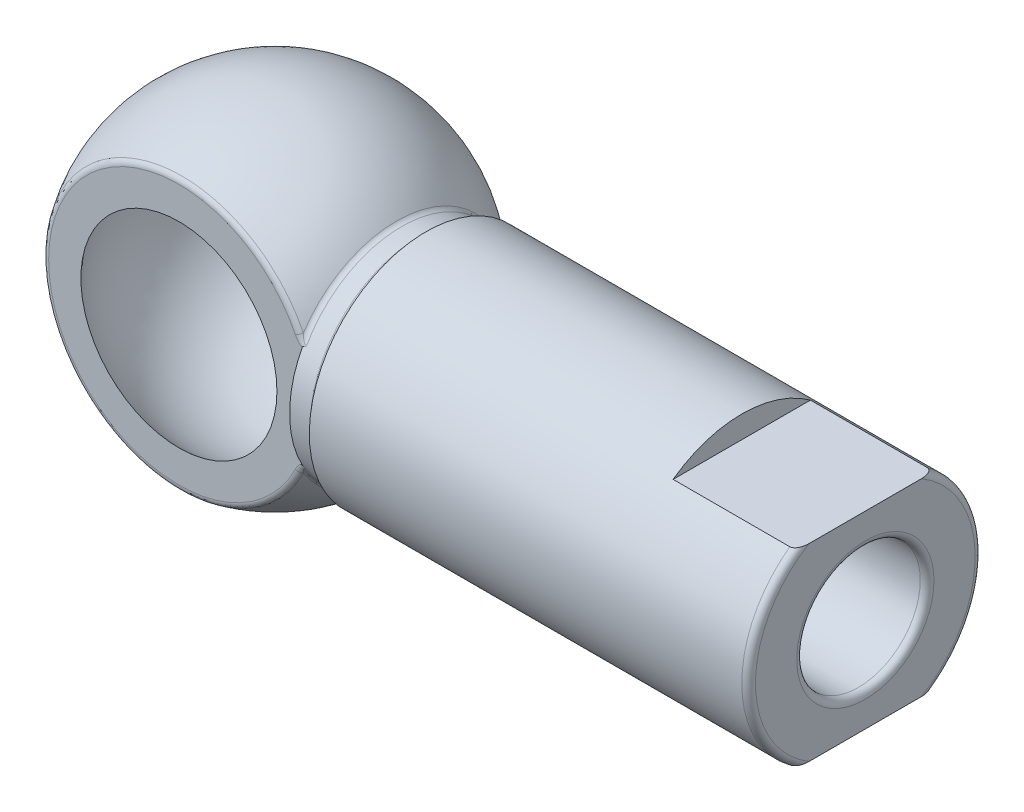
ISO-10303-21;
HEADER;
FILE_DESCRIPTION(('STEP AP214'),'2;1');
FILE_NAME('part.step','',(''),(''),'','','');
FILE_SCHEMA(('AUTOMOTIVE_DESIGN { 1 0 10303 214 1 1 1 1 }'));
ENDSEC;
DATA;
#1=APPLICATION_CONTEXT('core data for automotive mechanical design processes');
#2=APPLICATION_PROTOCOL_DEFINITION('international standard','automotive_design',2000,#1);
#3=PRODUCT_CONTEXT('',#1,'mechanical');
#4=PRODUCT('Part','Part','',(#3));
#5=PRODUCT_RELATED_PRODUCT_CATEGORY('part','',(#4));
#6=PRODUCT_DEFINITION_FORMATION('','',#4);
#7=PRODUCT_DEFINITION_CONTEXT('part definition',#1,'design');
#8=PRODUCT_DEFINITION('design','',#6,#7);
#9=PRODUCT_DEFINITION_SHAPE('','',#8);
#10=(LENGTH_UNIT() NAMED_UNIT(*) SI_UNIT(.MILLI.,.METRE.));
#11=(NAMED_UNIT(*) PLANE_ANGLE_UNIT() SI_UNIT($,.RADIAN.));
#12=(NAMED_UNIT(*) SI_UNIT($,.STERADIAN.) SOLID_ANGLE_UNIT());
#13=UNCERTAINTY_MEASURE_WITH_UNIT(LENGTH_MEASURE(1.E-05),#10,'distance_accuracy_value','');
#14=(GEOMETRIC_REPRESENTATION_CONTEXT(3) GLOBAL_UNCERTAINTY_ASSIGNED_CONTEXT((#13)) GLOBAL_UNIT_ASSIGNED_CONTEXT((#10,
#11,#12)) REPRESENTATION_CONTEXT('',''));
#15=CARTESIAN_POINT('',(0.,0.,0.));
#16=DIRECTION('',(0.,0.,1.));
#17=DIRECTION('',(1.,0.,0.));
#18=AXIS2_PLACEMENT_3D('',#15,#16,#17);
#19=CARTESIAN_POINT('',(0.,6.,3.5));
#20=DIRECTION('',(0.,0.,1.));
#21=DIRECTION('',(1.,0.,0.));
#22=AXIS2_PLACEMENT_3D('',#19,#20,#21);
#23=PLANE('',#22);
#24=CARTESIAN_POINT('',(0.,6.,3.5));
#25=DIRECTION('',(0.,0.,1.));
#26=DIRECTION('',(1.,0.,0.));
#27=AXIS2_PLACEMENT_3D('',#24,#25,#26);
#28=CIRCLE('',#27,3.57071421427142);
#29=CARTESIAN_POINT('',(3.57071421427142,6.,3.5));
#30=VERTEX_POINT('',#29);
#31=EDGE_CURVE('E158',#30,#30,#28,.F.);
#32=ORIENTED_EDGE('',*,*,#31,.T.);
#33=EDGE_LOOP('',(#32));
#34=FACE_BOUND('',#33,.T.);
#35=CARTESIAN_POINT('',(0.,6.,3.5));
#36=DIRECTION('',(0.,0.,1.));
#37=DIRECTION('',(1.,0.,0.));
#38=AXIS2_PLACEMENT_3D('',#35,#36,#37);
#39=CIRCLE('',#38,4.74341649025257);
#40=CARTESIAN_POINT('',(4.24255548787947,8.12149073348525,3.5));
#41=VERTEX_POINT('',#40);
#42=CARTESIAN_POINT('',(4.24255548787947,3.87850926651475,3.5));
#43=VERTEX_POINT('',#42);
#44=EDGE_CURVE('E173',#41,#43,#39,.T.);
#45=ORIENTED_EDGE('',*,*,#44,.T.);
#46=CARTESIAN_POINT('',(4.70713409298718,4.1739484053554,3.5));
#47=CARTESIAN_POINT('',(4.68135937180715,4.10917663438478,3.5));
#48=CARTESIAN_POINT('',(4.65930372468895,4.05375088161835,3.46392711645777));
#49=CARTESIAN_POINT('',(4.69370479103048,4.17933354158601,3.5));
#50=CARTESIAN_POINT('',(4.67163926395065,4.11453738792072,3.5));
#51=CARTESIAN_POINT('',(4.65258907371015,4.05876059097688,3.46522809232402));
#52=CARTESIAN_POINT('',(4.67982011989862,4.18366827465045,3.5));
#53=CARTESIAN_POINT('',(4.66151355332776,4.11886056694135,3.5));
#54=CARTESIAN_POINT('',(4.64564673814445,4.06279844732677,3.46627411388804));
#55=CARTESIAN_POINT('',(4.6515632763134,4.18997125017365,3.5));
#56=CARTESIAN_POINT('',(4.64086396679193,4.12514338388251,3.5));
#57=CARTESIAN_POINT('',(4.63151831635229,4.0686736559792,3.46779421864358));
#58=CARTESIAN_POINT('',(4.63719234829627,4.19194512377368,3.5));
#59=CARTESIAN_POINT('',(4.6303292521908,4.12711627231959,3.5));
#60=CARTESIAN_POINT('',(4.62433285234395,4.07051624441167,3.4682696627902));
#61=CARTESIAN_POINT('',(4.60825410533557,4.19329187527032,3.5));
#62=CARTESIAN_POINT('',(4.60911687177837,4.12846048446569,3.5));
#63=CARTESIAN_POINT('',(4.6098637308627,4.07177322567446,3.46859409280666));
#64=CARTESIAN_POINT('',(4.59368620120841,4.19265314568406,3.5));
#65=CARTESIAN_POINT('',(4.59842447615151,4.12782201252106,3.5));
#66=CARTESIAN_POINT('',(4.60257977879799,4.07117678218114,3.4684402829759));
#67=CARTESIAN_POINT('',(4.56491075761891,4.18884175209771,3.5));
#68=CARTESIAN_POINT('',(4.57735027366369,4.12401989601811,3.5));
#69=CARTESIAN_POINT('',(4.5881920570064,4.0676210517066,3.46752177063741));
#70=CARTESIAN_POINT('',(4.55070300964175,4.1856705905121,3.5));
#71=CARTESIAN_POINT('',(4.56695480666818,4.12085278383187,3.5));
#72=CARTESIAN_POINT('',(4.58108818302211,4.06466316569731,3.46675743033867));
#73=CARTESIAN_POINT('',(4.50314323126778,4.17095174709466,3.5));
#74=CARTESIAN_POINT('',(4.5322687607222,4.10615988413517,3.5));
#75=CARTESIAN_POINT('',(4.55730829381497,4.0509556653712,3.46320474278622));
#76=CARTESIAN_POINT('',(4.47148156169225,4.15391077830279,3.5));
#77=CARTESIAN_POINT('',(4.5094051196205,4.08910384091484,3.5));
#78=CARTESIAN_POINT('',(4.54147745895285,4.0351128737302,3.45908516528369));
#79=CARTESIAN_POINT('',(4.41992944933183,4.11688378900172,3.5));
#80=CARTESIAN_POINT('',(4.47298761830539,4.0524044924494,3.5));
#81=CARTESIAN_POINT('',(4.51570140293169,4.00093010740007,3.45008537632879));
#82=CARTESIAN_POINT('',(4.39895727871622,4.09822405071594,3.5));
#83=CARTESIAN_POINT('',(4.4584368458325,4.03389073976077,3.5));
#84=CARTESIAN_POINT('',(4.50521531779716,3.98377364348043,3.44553579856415));
#85=CARTESIAN_POINT('',(4.35992104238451,4.05801917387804,3.5));
#86=CARTESIAN_POINT('',(4.43194703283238,3.99421908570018,3.5));
#87=CARTESIAN_POINT('',(4.48569719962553,3.9470297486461,3.43569511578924));
#88=CARTESIAN_POINT('',(4.34186227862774,4.0364689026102,3.5));
#89=CARTESIAN_POINT('',(4.42001799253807,3.9729900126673,3.5));
#90=CARTESIAN_POINT('',(4.47666781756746,3.92743799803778,3.43040269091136));
#91=CARTESIAN_POINT('',(4.30924052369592,3.99275958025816,3.5));
#92=CARTESIAN_POINT('',(4.39913473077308,3.93018854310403,3.5));
#93=CARTESIAN_POINT('',(4.46035693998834,3.88795814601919,3.41963252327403));
#94=CARTESIAN_POINT('',(4.29453898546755,3.97070101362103,3.5));
#95=CARTESIAN_POINT('',(4.39005854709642,3.90864071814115,3.5));
#96=CARTESIAN_POINT('',(4.45300617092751,3.86814710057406,3.41418144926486));
#97=CARTESIAN_POINT('',(4.26711587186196,3.92541129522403,3.5));
#98=CARTESIAN_POINT('',(4.37380297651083,3.86464894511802,3.5));
#99=CARTESIAN_POINT('',(4.43929461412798,3.82773144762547,3.40296159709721));
#100=CARTESIAN_POINT('',(4.25439326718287,3.90218076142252,3.5));
#101=CARTESIAN_POINT('',(4.36664007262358,3.84216887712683,3.5));
#102=CARTESIAN_POINT('',(4.4329333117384,3.80712725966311,3.39719298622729));
#103=CARTESIAN_POINT('',(4.22727881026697,3.84796115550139,3.5));
#104=CARTESIAN_POINT('',(4.35221685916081,3.78991929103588,3.5));
#105=CARTESIAN_POINT('',(4.41937608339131,3.75935489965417,3.38370504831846));
#106=CARTESIAN_POINT('',(4.21347571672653,3.81667866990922,3.5));
#107=CARTESIAN_POINT('',(4.34561350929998,3.76001783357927,3.5));
#108=CARTESIAN_POINT('',(4.41247453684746,3.73201869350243,3.37590585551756));
#109=CARTESIAN_POINT('',(4.18854467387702,3.75303758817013,3.5));
#110=CARTESIAN_POINT('',(4.33516873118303,3.69979581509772,3.5));
#111=CARTESIAN_POINT('',(4.40000901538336,3.67689331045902,3.36002206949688));
#112=CARTESIAN_POINT('',(4.17741969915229,3.72067784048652,3.5));
#113=CARTESIAN_POINT('',(4.33138394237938,3.66942227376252,3.5));
#114=CARTESIAN_POINT('',(4.39444652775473,3.64910366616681,3.35193717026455));
#115=CARTESIAN_POINT('',(4.15776146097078,3.65526989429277,3.5));
#116=CARTESIAN_POINT('',(4.32654697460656,3.60878352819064,3.5));
#117=CARTESIAN_POINT('',(4.3846174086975,3.59343278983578,3.33559819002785));
#118=CARTESIAN_POINT('',(4.14922190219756,3.62222358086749,3.5));
#119=CARTESIAN_POINT('',(4.32555058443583,3.57847396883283,3.5));
#120=CARTESIAN_POINT('',(4.3803476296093,3.56555195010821,3.32734457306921));
#121=CARTESIAN_POINT('',(4.13470586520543,3.55564646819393,3.5));
#122=CARTESIAN_POINT('',(4.32629287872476,3.51834245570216,3.5));
#123=CARTESIAN_POINT('',(4.373089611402,3.50987869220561,3.31073883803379));
#124=CARTESIAN_POINT('',(4.12872392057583,3.52211686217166,3.5));
#125=CARTESIAN_POINT('',(4.32809905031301,3.48848661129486,3.5));
#126=CARTESIAN_POINT('',(4.37009863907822,3.4820862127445,3.30238696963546));
#127=CARTESIAN_POINT('',(4.12400652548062,3.48841423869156,3.5));
#128=CARTESIAN_POINT('',(4.33125371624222,3.45949289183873,3.5));
#129=CARTESIAN_POINT('',(4.36773994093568,3.45440123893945,3.2940129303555));
#130=(BOUNDED_SURFACE() B_SPLINE_SURFACE(3,2,((#46,#47,#48),(#49,#50,#51),(#52,#53,#54),(#55,
#56,#57),(#58,#59,#60),(#61,#62,#63),(#64,#65,#66),(#67,#68,#69),(#70,#71,#72),(#73,#74,#75),
(#76,#77,#78),(#79,#80,#81),(#82,#83,#84),(#85,#86,#87),(#88,#89,#90),(#91,#92,#93),(#94,#95,
#96),(#97,#98,#99),(#100,#101,#102),(#103,#104,#105),(#106,#107,#108),(#109,#110,#111),(#112,
#113,#114),(#115,#116,#117),(#118,#119,#120),(#121,#122,#123),(#124,#125,#126),(#127,#128,
#129)),.UNSPECIFIED.,.F.,.F.,.F.) B_SPLINE_SURFACE_WITH_KNOTS((4,2,2,2,2,2,2,2,2,2,2,2,2,4),(3,
3),(0.,0.0434124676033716,0.086721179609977,0.130222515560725,0.173698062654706,
0.279370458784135,0.363311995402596,0.44740461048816,0.526821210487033,0.606196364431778,
0.708630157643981,0.811177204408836,0.913472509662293,1.01554807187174),(0.,1.),
.UNSPECIFIED.) GEOMETRIC_REPRESENTATION_ITEM() RATIONAL_B_SPLINE_SURFACE(((1.,0.963251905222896,
1.),(1.,0.964602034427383,1.),(1.,0.965685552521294,1.),(1.,0.967258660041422,1.),(1.,
0.967749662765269,1.),(1.,0.968084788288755,1.),(1.,0.967926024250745,1.),(1.,0.966976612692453,
1.),(1.,0.966186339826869,1.),(1.,0.962505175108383,1.),(1.,0.958226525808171,1.),(1.,
0.948782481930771,1.),(1.,0.943980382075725,1.),(1.,0.933497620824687,1.),(1.,0.927815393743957,
1.),(1.,0.91613172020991,1.),(1.,0.910165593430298,1.),(1.,0.897753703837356,1.),(1.,
0.891308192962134,1.),(1.,0.876061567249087,1.),(1.,0.867120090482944,1.),(1.,0.848604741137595,
1.),(1.,0.839030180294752,1.),(1.,0.819324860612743,1.),(1.,0.809195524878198,1.),(1.,
0.78840694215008,1.),(1.,0.777748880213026,1.),(1.,0.766828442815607,1.))) REPRESENTATION_ITEM('') SURFACE());
#131=CARTESIAN_POINT('',(4.12400652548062,3.48841423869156,3.5));
#132=CARTESIAN_POINT('',(4.12872392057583,3.52211686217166,3.5));
#133=CARTESIAN_POINT('',(4.13470586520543,3.55564646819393,3.5));
#134=CARTESIAN_POINT('',(4.14922190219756,3.62222358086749,3.5));
#135=CARTESIAN_POINT('',(4.15776146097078,3.65526989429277,3.5));
#136=CARTESIAN_POINT('',(4.17741969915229,3.72067784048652,3.5));
#137=CARTESIAN_POINT('',(4.18854467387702,3.75303758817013,3.5));
#138=CARTESIAN_POINT('',(4.21347571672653,3.81667866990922,3.5));
#139=CARTESIAN_POINT('',(4.22727881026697,3.84796115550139,3.5));
#140=CARTESIAN_POINT('',(4.25439326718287,3.90218076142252,3.5));
#141=CARTESIAN_POINT('',(4.26711587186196,3.92541129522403,3.5));
#142=CARTESIAN_POINT('',(4.29453898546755,3.97070101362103,3.5));
#143=CARTESIAN_POINT('',(4.30924052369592,3.99275958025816,3.5));
#144=CARTESIAN_POINT('',(4.34186227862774,4.0364689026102,3.5));
#145=CARTESIAN_POINT('',(4.35992104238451,4.05801917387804,3.5));
#146=CARTESIAN_POINT('',(4.39895727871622,4.09822405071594,3.5));
#147=CARTESIAN_POINT('',(4.41992944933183,4.11688378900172,3.5));
#148=CARTESIAN_POINT('',(4.47148156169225,4.15391077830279,3.5));
#149=CARTESIAN_POINT('',(4.50314323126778,4.17095174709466,3.5));
#150=CARTESIAN_POINT('',(4.55070300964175,4.1856705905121,3.5));
#151=CARTESIAN_POINT('',(4.56491075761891,4.18884175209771,3.5));
#152=CARTESIAN_POINT('',(4.59368620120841,4.19265314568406,3.5));
#153=CARTESIAN_POINT('',(4.60825410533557,4.19329187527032,3.5));
#154=CARTESIAN_POINT('',(4.63719234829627,4.19194512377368,3.5));
#155=CARTESIAN_POINT('',(4.6515632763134,4.18997125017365,3.5));
#156=CARTESIAN_POINT('',(4.67982011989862,4.18366827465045,3.5));
#157=CARTESIAN_POINT('',(4.69370479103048,4.17933354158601,3.5));
#158=CARTESIAN_POINT('',(4.70713409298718,4.1739484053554,3.5));
#159=B_SPLINE_CURVE_WITH_KNOTS('',3,(#131,#132,#133,#134,#135,#136,#137,#138,#139,#140,#141,
#142,#143,#144,#145,#146,#147,#148,#149,#150,#151,#152,#153,#154,#155,#156,#157,#158),
.UNSPECIFIED.,.F.,.F.,(4,2,2,2,2,2,2,2,2,2,2,2,2,4),(0.,0.102075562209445,0.204370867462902,
0.306917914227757,0.409351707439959,0.488726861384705,0.568143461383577,0.652236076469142,
0.736177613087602,0.841850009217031,0.885325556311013,0.928826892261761,0.972135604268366,
1.01554807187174),.UNSPECIFIED.);
#160=CARTESIAN_POINT('',(4.5,4.1671223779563,3.5));
#161=VERTEX_POINT('',#160);
#162=EDGE_CURVE('E182',#43,#161,#159,.T.);
#163=ORIENTED_EDGE('',*,*,#162,.T.);
#164=DIRECTION('',(0.,1.,0.));
#165=VECTOR('',#164,1.);
#166=CARTESIAN_POINT('',(4.5,6.,3.5));
#167=LINE('',#166,#165);
#168=CARTESIAN_POINT('',(4.5,7.8328776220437,3.5));
#169=VERTEX_POINT('',#168);
#170=EDGE_CURVE('E155',#161,#169,#167,.T.);
#171=ORIENTED_EDGE('',*,*,#170,.T.);
#172=CARTESIAN_POINT('',(4.1908016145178,8.24213679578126,3.5));
#173=CARTESIAN_POINT('',(4.33637297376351,8.29524266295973,3.5));
#174=CARTESIAN_POINT('',(4.40113748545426,8.31886939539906,3.36122468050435));
#175=CARTESIAN_POINT('',(4.19827350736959,8.22166654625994,3.5));
#176=CARTESIAN_POINT('',(4.3391786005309,8.27611347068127,3.5));
#177=CARTESIAN_POINT('',(4.40487343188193,8.30122555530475,3.36633632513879));
#178=CARTESIAN_POINT('',(4.20627771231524,8.20138881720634,3.5));
#179=CARTESIAN_POINT('',(4.34256442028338,8.25690098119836,3.5));
#180=CARTESIAN_POINT('',(4.40887553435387,8.28364832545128,3.37139745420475));
#181=CARTESIAN_POINT('',(4.22349599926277,8.16113522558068,3.5));
#182=CARTESIAN_POINT('',(4.35055226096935,8.2185798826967,3.5));
#183=CARTESIAN_POINT('',(4.41748467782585,8.24856618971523,3.38143509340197));
#184=CARTESIAN_POINT('',(4.23272047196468,8.1411638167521,3.5));
#185=CARTESIAN_POINT('',(4.35515223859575,8.1994560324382,3.5));
#186=CARTESIAN_POINT('',(4.42209691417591,8.23106341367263,3.3864104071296));
#187=CARTESIAN_POINT('',(4.26150128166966,8.0835932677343,3.5));
#188=CARTESIAN_POINT('',(4.37033858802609,8.14441576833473,3.5));
#189=CARTESIAN_POINT('',(4.43648731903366,8.18033800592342,3.40073184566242));
#190=CARTESIAN_POINT('',(4.28271272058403,8.0468028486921,3.5));
#191=CARTESIAN_POINT('',(4.38262928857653,8.10864800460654,3.5));
#192=CARTESIAN_POINT('',(4.44709303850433,8.14757303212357,3.409857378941));
#193=CARTESIAN_POINT('',(4.3305056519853,7.97694839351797,3.5));
#194=CARTESIAN_POINT('',(4.4124068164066,8.04042009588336,3.5));
#195=CARTESIAN_POINT('',(4.47098950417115,8.08477311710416,3.42710849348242));
#196=CARTESIAN_POINT('',(4.3570578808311,7.94386551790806,3.5));
#197=CARTESIAN_POINT('',(4.42980074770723,8.00778760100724,3.5));
#198=CARTESIAN_POINT('',(4.48426561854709,8.05472453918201,3.43523915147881));
#199=CARTESIAN_POINT('',(4.39982636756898,7.90155680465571,3.5));
#200=CARTESIAN_POINT('',(4.45913983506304,7.96581526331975,3.5));
#201=CARTESIAN_POINT('',(4.50564986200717,8.01600553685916,3.44558597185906));
#202=CARTESIAN_POINT('',(4.41324966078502,7.88952127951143,3.5));
#203=CARTESIAN_POINT('',(4.46843726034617,7.95389394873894,3.5));
#204=CARTESIAN_POINT('',(4.51236150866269,8.0049496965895,3.44852201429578));
#205=CARTESIAN_POINT('',(4.44148820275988,7.86716859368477,3.5));
#206=CARTESIAN_POINT('',(4.48823944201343,7.93173872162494,3.5));
#207=CARTESIAN_POINT('',(4.52648077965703,7.98435765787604,3.45396359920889));
#208=CARTESIAN_POINT('',(4.45630365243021,7.85685168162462,3.5));
#209=CARTESIAN_POINT('',(4.49874709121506,7.92148379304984,3.5));
#210=CARTESIAN_POINT('',(4.53388850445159,7.97482167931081,3.45646907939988));
#211=CARTESIAN_POINT('',(4.48757098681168,7.83845428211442,3.5));
#212=CARTESIAN_POINT('',(4.52112304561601,7.90319673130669,3.5));
#213=CARTESIAN_POINT('',(4.54952217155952,7.95777864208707,3.46092891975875));
#214=CARTESIAN_POINT('',(4.5040424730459,7.83040629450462,3.5));
#215=CARTESIAN_POINT('',(4.53301763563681,7.89517244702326,3.5));
#216=CARTESIAN_POINT('',(4.5577579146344,7.95030110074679,3.46287527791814));
#217=CARTESIAN_POINT('',(4.53819940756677,7.8175918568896,3.5));
#218=CARTESIAN_POINT('',(4.55781983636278,7.88240636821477,3.5));
#219=CARTESIAN_POINT('',(4.57483638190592,7.93837849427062,3.46597071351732));
#220=CARTESIAN_POINT('',(4.55588038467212,7.81281397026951,3.5));
#221=CARTESIAN_POINT('',(4.57074124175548,7.87763156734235,3.5));
#222=CARTESIAN_POINT('',(4.58367687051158,7.93392286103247,3.46712256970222));
#223=CARTESIAN_POINT('',(4.59000630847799,7.80753870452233,3.5));
#224=CARTESIAN_POINT('',(4.5957213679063,7.87237110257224,3.5));
#225=CARTESIAN_POINT('',(4.60073983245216,7.92900275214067,3.46839418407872));
#226=CARTESIAN_POINT('',(4.60639001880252,7.80664979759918,3.5));
#227=CARTESIAN_POINT('',(4.6077495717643,7.87148445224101,3.5));
#228=CARTESIAN_POINT('',(4.60893168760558,7.92817322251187,3.46860834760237));
#229=CARTESIAN_POINT('',(4.63922375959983,7.80812064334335,3.5));
#230=CARTESIAN_POINT('',(4.63182010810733,7.87294622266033,3.5));
#231=CARTESIAN_POINT('',(4.62534855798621,7.929544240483,3.46825361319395));
#232=CARTESIAN_POINT('',(4.65567186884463,7.81052291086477,3.5));
#233=CARTESIAN_POINT('',(4.64388108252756,7.87533950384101,3.5));
#234=CARTESIAN_POINT('',(4.63357261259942,7.9317844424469,3.46767446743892));
#235=CARTESIAN_POINT('',(4.67170781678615,7.81460248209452,3.5));
#236=CARTESIAN_POINT('',(4.65557443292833,7.87941363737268,3.5));
#237=CARTESIAN_POINT('',(4.64159058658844,7.93558965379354,3.46669115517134));
#238=(BOUNDED_SURFACE() B_SPLINE_SURFACE(3,2,((#172,#173,#174),(#175,#176,#177),(#178,#179,
#180),(#181,#182,#183),(#184,#185,#186),(#187,#188,#189),(#190,#191,#192),(#193,#194,#195),
(#196,#197,#198),(#199,#200,#201),(#202,#203,#204),(#205,#206,#207),(#208,#209,#210),(#211,#212,
#213),(#214,#215,#216),(#217,#218,#219),(#220,#221,#222),(#223,#224,#225),(#226,#227,#228),
(#229,#230,#231),(#232,#233,#234),(#235,#236,#237)),.UNSPECIFIED.,.F.,.F.,
.F.) B_SPLINE_SURFACE_WITH_KNOTS((4,2,2,2,2,2,2,2,2,2,4),(3,3),(0.,0.0653667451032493,
0.131331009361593,0.258402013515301,0.384794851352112,0.438779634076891,0.49277221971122,
0.547502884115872,0.602041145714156,0.650940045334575,0.700476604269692),(0.,1.),
.UNSPECIFIED.) GEOMETRIC_REPRESENTATION_ITEM() RATIONAL_B_SPLINE_SURFACE(((1.,0.849970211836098,
1.),(1.,0.855984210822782,1.),(1.,0.861874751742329,1.),(1.,0.873443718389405,1.),(1.,
0.879119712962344,1.),(1.,0.895308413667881,1.),(1.,0.905430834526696,1.),(1.,0.924285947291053,
1.),(1.,0.933025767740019,1.),(1.,0.944024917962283,1.),(1.,0.94712845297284,1.),(1.,
0.952856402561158,1.),(1.,0.955480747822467,1.),(1.,0.96013716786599,1.),(1.,0.96216065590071,
1.),(1.,0.965372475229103,1.),(1.,0.966563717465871,1.),(1.,0.967878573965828,1.),(1.,
0.968099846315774,1.),(1.,0.967732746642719,1.),(1.,0.967133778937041,1.),(1.,0.966117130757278,1.))) REPRESENTATION_ITEM('') SURFACE());
#239=CARTESIAN_POINT('',(4.67170781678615,7.81460248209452,3.5));
#240=CARTESIAN_POINT('',(4.65567186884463,7.81052291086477,3.5));
#241=CARTESIAN_POINT('',(4.63922375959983,7.80812064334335,3.5));
#242=CARTESIAN_POINT('',(4.60639001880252,7.80664979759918,3.5));
#243=CARTESIAN_POINT('',(4.59000630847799,7.80753870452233,3.5));
#244=CARTESIAN_POINT('',(4.55588038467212,7.81281397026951,3.5));
#245=CARTESIAN_POINT('',(4.53819940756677,7.8175918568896,3.5));
#246=CARTESIAN_POINT('',(4.5040424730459,7.83040629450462,3.5));
#247=CARTESIAN_POINT('',(4.48757098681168,7.83845428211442,3.5));
#248=CARTESIAN_POINT('',(4.45630365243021,7.85685168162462,3.5));
#249=CARTESIAN_POINT('',(4.44148820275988,7.86716859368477,3.5));
#250=CARTESIAN_POINT('',(4.41324966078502,7.88952127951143,3.5));
#251=CARTESIAN_POINT('',(4.39982636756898,7.90155680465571,3.5));
#252=CARTESIAN_POINT('',(4.3570578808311,7.94386551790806,3.5));
#253=CARTESIAN_POINT('',(4.3305056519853,7.97694839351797,3.5));
#254=CARTESIAN_POINT('',(4.28271272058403,8.0468028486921,3.5));
#255=CARTESIAN_POINT('',(4.26150128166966,8.0835932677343,3.5));
#256=CARTESIAN_POINT('',(4.23272047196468,8.1411638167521,3.5));
#257=CARTESIAN_POINT('',(4.22349599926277,8.16113522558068,3.5));
#258=CARTESIAN_POINT('',(4.20627771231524,8.20138881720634,3.5));
#259=CARTESIAN_POINT('',(4.19827350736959,8.22166654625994,3.5));
#260=CARTESIAN_POINT('',(4.1908016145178,8.24213679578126,3.5));
#261=B_SPLINE_CURVE_WITH_KNOTS('',3,(#239,#240,#241,#242,#243,#244,#245,#246,#247,#248,#249,
#250,#251,#252,#253,#254,#255,#256,#257,#258,#259,#260),.UNSPECIFIED.,.F.,.F.,(4,2,2,2,2,2,2,2,
2,2,4),(0.,0.0495365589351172,0.0984354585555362,0.152973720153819,0.207704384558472,
0.2616969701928,0.31568175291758,0.442074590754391,0.569145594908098,0.635109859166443,
0.700476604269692),.UNSPECIFIED.);
#262=EDGE_CURVE('E175',#169,#41,#261,.T.);
#263=ORIENTED_EDGE('',*,*,#262,.T.);
#264=EDGE_LOOP('',(#45,#163,#171,#263));
#265=FACE_BOUND('',#264,.T.);
#266=ADVANCED_FACE('F26',(#34,#265),#23,.T.);
#267=CARTESIAN_POINT('',(0.,6.,0.));
#268=DIRECTION('',(0.,-1.,0.));
#269=DIRECTION('',(-1.,0.,0.));
#270=AXIS2_PLACEMENT_3D('',#267,#268,#269);
#271=SPHERICAL_SURFACE('',#270,6.);
#272=CARTESIAN_POINT('',(4.4270144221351,6.,0.));
#273=DIRECTION('',(-1.,0.,0.));
#274=DIRECTION('',(0.,0.,1.));
#275=AXIS2_PLACEMENT_3D('',#272,#273,#274);
#276=CIRCLE('',#275,4.04988188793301);
#277=CARTESIAN_POINT('',(4.4270144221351,8.21372946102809,3.39130434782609));
#278=VERTEX_POINT('',#277);
#279=CARTESIAN_POINT('',(4.4270144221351,3.78627053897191,3.39130434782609));
#280=VERTEX_POINT('',#279);
#281=EDGE_CURVE('E161',#278,#280,#276,.T.);
#282=ORIENTED_EDGE('',*,*,#281,.T.);
#283=CARTESIAN_POINT('',(0.,6.,3.39130434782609));
#284=DIRECTION('',(0.,0.,-1.));
#285=DIRECTION('',(-1.,0.,0.));
#286=AXIS2_PLACEMENT_3D('',#283,#284,#285);
#287=CIRCLE('',#286,4.94965198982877);
#288=EDGE_CURVE('E271',#280,#278,#287,.T.);
#289=ORIENTED_EDGE('',*,*,#288,.T.);
#290=EDGE_LOOP('',(#282,#289));
#291=FACE_BOUND('',#290,.T.);
#292=ADVANCED_FACE('F193',(#291),#271,.T.);
#293=CARTESIAN_POINT('',(0.,6.,0.));
#294=DIRECTION('',(0.,-1.,0.));
#295=DIRECTION('',(-1.,0.,0.));
#296=AXIS2_PLACEMENT_3D('',#293,#294,#295);
#297=SPHERICAL_SURFACE('',#296,5.);
#298=CARTESIAN_POINT('',(4.46514277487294,6.,0.));
#299=DIRECTION('',(-1.,0.,0.));
#300=DIRECTION('',(0.,0.,1.));
#301=AXIS2_PLACEMENT_3D('',#298,#299,#300);
#302=CIRCLE('',#301,2.25);
#303=CARTESIAN_POINT('',(4.46514277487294,6.,2.25));
#304=VERTEX_POINT('',#303);
#305=EDGE_CURVE('E146',#304,#304,#302,.T.);
#306=ORIENTED_EDGE('',*,*,#305,.F.);
#307=EDGE_LOOP('',(#306));
#308=FACE_BOUND('',#307,.T.);
#309=ORIENTED_EDGE('',*,*,#31,.F.);
#310=EDGE_LOOP('',(#309));
#311=FACE_BOUND('',#310,.T.);
#312=ADVANCED_FACE('F195',(#308,#311),#297,.F.);
#313=CARTESIAN_POINT('',(4.5,6.,0.));
#314=DIRECTION('',(1.,0.,0.));
#315=DIRECTION('',(0.,0.,-1.));
#316=AXIS2_PLACEMENT_3D('',#313,#314,#315);
#317=PLANE('',#316);
#318=ORIENTED_EDGE('',*,*,#170,.F.);
#319=CARTESIAN_POINT('',(4.5,4.1671223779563,3.5));
#320=CARTESIAN_POINT('',(4.5,4.1598106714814,3.49999311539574));
#321=CARTESIAN_POINT('',(4.5,4.15251655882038,3.49973494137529));
#322=CARTESIAN_POINT('',(4.5,4.13796376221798,3.498716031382));
#323=CARTESIAN_POINT('',(4.5,4.13070507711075,3.49795531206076));
#324=CARTESIAN_POINT('',(4.5,4.12346398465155,3.49694331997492));
#325=B_SPLINE_CURVE_WITH_KNOTS('',3,(#319,#320,#321,#322,#323,#324),.UNSPECIFIED.,.F.,.F.,(4,2,
4),(0.,0.0218960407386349,0.0437913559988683),.UNSPECIFIED.);
#326=CARTESIAN_POINT('',(4.5,4.12346398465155,3.49694331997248));
#327=VERTEX_POINT('',#326);
#328=EDGE_CURVE('E264',#161,#327,#325,.T.);
#329=ORIENTED_EDGE('',*,*,#328,.T.);
#330=CARTESIAN_POINT('',(4.5,6.,0.));
#331=DIRECTION('',(1.,0.,0.));
#332=DIRECTION('',(0.,0.,-1.));
#333=AXIS2_PLACEMENT_3D('',#330,#331,#332);
#334=CIRCLE('',#333,3.96862696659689);
#335=CARTESIAN_POINT('',(4.5,7.87653601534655,3.4969433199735));
#336=VERTEX_POINT('',#335);
#337=EDGE_CURVE('E46',#336,#327,#334,.T.);
#338=ORIENTED_EDGE('',*,*,#337,.F.);
#339=CARTESIAN_POINT('',(4.5,7.87653601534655,3.4969433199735));
#340=CARTESIAN_POINT('',(4.5,7.86929484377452,3.49795378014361));
#341=CARTESIAN_POINT('',(4.5,7.86203613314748,3.49871373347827));
#342=CARTESIAN_POINT('',(4.5,7.84748333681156,3.49973264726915));
#343=CARTESIAN_POINT('',(4.5,7.84018924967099,3.49999158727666));
#344=CARTESIAN_POINT('',(4.5,7.8328776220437,3.5));
#345=B_SPLINE_CURVE_WITH_KNOTS('',3,(#339,#340,#341,#342,#343,#344),.UNSPECIFIED.,.F.,.F.,(4,2,
4),(0.,0.0218951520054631,0.0437911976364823),.UNSPECIFIED.);
#346=EDGE_CURVE('E11',#336,#169,#345,.T.);
#347=ORIENTED_EDGE('',*,*,#346,.T.);
#348=EDGE_LOOP('',(#318,#329,#338,#347));
#349=FACE_BOUND('',#348,.T.);
#350=ADVANCED_FACE('F258',(#349),#317,.F.);
#351=CARTESIAN_POINT('',(5.5,6.,0.));
#352=DIRECTION('',(-1.,0.,0.));
#353=DIRECTION('',(0.,0.,1.));
#354=AXIS2_PLACEMENT_3D('',#351,#352,#353);
#355=CYLINDRICAL_SURFACE('',#354,3.96862696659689);
#356=CARTESIAN_POINT('',(5.25,6.,0.));
#357=DIRECTION('',(1.,0.,0.));
#358=DIRECTION('',(0.,0.,-1.));
#359=AXIS2_PLACEMENT_3D('',#356,#357,#358);
#360=CIRCLE('',#359,3.96862696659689);
#361=CARTESIAN_POINT('',(5.25,6.,-3.96862696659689));
#362=VERTEX_POINT('',#361);
#363=EDGE_CURVE('E164',#362,#362,#360,.F.);
#364=ORIENTED_EDGE('',*,*,#363,.T.);
#365=EDGE_LOOP('',(#364));
#366=FACE_BOUND('',#365,.T.);
#367=ORIENTED_EDGE('',*,*,#337,.T.);
#368=CARTESIAN_POINT('',(4.5,4.12346398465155,3.49694331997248));
#369=CARTESIAN_POINT('',(4.51164547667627,4.121273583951,3.49576637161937));
#370=CARTESIAN_POINT('',(4.52315617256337,4.11836636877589,3.49420507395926));
#371=CARTESIAN_POINT('',(4.54559710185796,4.1110501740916,3.49025628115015));
#372=CARTESIAN_POINT('',(4.55652437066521,4.10663423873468,3.4878649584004));
#373=CARTESIAN_POINT('',(4.57466420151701,4.09760039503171,3.4829433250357));
#374=CARTESIAN_POINT('',(4.5821043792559,4.09333291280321,3.48061047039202));
#375=CARTESIAN_POINT('',(4.59623551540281,4.08397158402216,3.47546594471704));
#376=CARTESIAN_POINT('',(4.60292895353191,4.07888061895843,3.47265594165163));
#377=CARTESIAN_POINT('',(4.60995212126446,4.07275000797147,3.46925180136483));
#378=CARTESIAN_POINT('',(4.61071616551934,4.07207163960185,3.46887486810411));
#379=CARTESIAN_POINT('',(4.61147335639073,4.07138779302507,3.46849462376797));
#380=B_SPLINE_CURVE_WITH_KNOTS('',3,(#368,#369,#370,#371,#372,#373,#374,#375,#376,#377,#378,
#379),.UNSPECIFIED.,.F.,.F.,(4,2,2,2,2,4),(0.,0.0357579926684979,0.071683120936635,
0.0982764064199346,0.124778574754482,0.128045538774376),.UNSPECIFIED.);
#381=CARTESIAN_POINT('',(4.61147335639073,4.07138779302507,3.46849462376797));
#382=VERTEX_POINT('',#381);
#383=EDGE_CURVE('E270',#327,#382,#380,.T.);
#384=ORIENTED_EDGE('',*,*,#383,.T.);
#385=CARTESIAN_POINT('',(4.61147335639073,6.,0.));
#386=DIRECTION('',(-1.,0.,0.));
#387=DIRECTION('',(0.,0.,1.));
#388=AXIS2_PLACEMENT_3D('',#385,#386,#387);
#389=CIRCLE('',#388,3.96862696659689);
#390=CARTESIAN_POINT('',(4.61147335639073,7.92861220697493,3.46849462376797));
#391=VERTEX_POINT('',#390);
#392=EDGE_CURVE('E167',#382,#391,#389,.F.);
#393=ORIENTED_EDGE('',*,*,#392,.T.);
#394=CARTESIAN_POINT('',(4.5,7.87653601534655,3.4969433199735));
#395=CARTESIAN_POINT('',(4.51195797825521,7.87880060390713,3.49572634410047));
#396=CARTESIAN_POINT('',(4.52378248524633,7.88181036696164,3.49411002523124));
#397=CARTESIAN_POINT('',(4.54680475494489,7.88940593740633,3.49000964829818));
#398=CARTESIAN_POINT('',(4.55799973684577,7.89399818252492,3.48752204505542));
#399=CARTESIAN_POINT('',(4.57604158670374,7.90317129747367,3.48252158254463));
#400=CARTESIAN_POINT('',(4.58317125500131,7.90732624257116,3.48024905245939));
#401=CARTESIAN_POINT('',(4.59672881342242,7.9164017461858,3.47525986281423));
#402=CARTESIAN_POINT('',(4.60315890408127,7.9213197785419,3.47254466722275));
#403=CARTESIAN_POINT('',(4.60995209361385,7.92725000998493,3.46925179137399));
#404=CARTESIAN_POINT('',(4.61071613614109,7.92792837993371,3.46887485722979));
#405=CARTESIAN_POINT('',(4.61147335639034,7.92861220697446,3.46849462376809));
#406=B_SPLINE_CURVE_WITH_KNOTS('',3,(#394,#395,#396,#397,#398,#399,#400,#401,#402,#403,#404,
#405),.UNSPECIFIED.,.F.,.F.,(4,2,2,2,2,4),(0.,0.0367415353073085,0.0736343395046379,
0.0992457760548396,0.124774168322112,0.128041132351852),.UNSPECIFIED.);
#407=EDGE_CURVE('E40',#391,#336,#406,.F.);
#408=ORIENTED_EDGE('',*,*,#407,.T.);
#409=EDGE_LOOP('',(#367,#384,#393,#408));
#410=FACE_BOUND('',#409,.T.);
#411=ADVANCED_FACE('F245',(#366,#410),#355,.T.);
#412=CARTESIAN_POINT('',(5.5,6.,0.));
#413=DIRECTION('',(1.,0.,0.));
#414=DIRECTION('',(0.,0.,-1.));
#415=AXIS2_PLACEMENT_3D('',#412,#413,#414);
#416=PLANE('',#415);
#417=CARTESIAN_POINT('',(5.5,6.,0.));
#418=DIRECTION('',(1.,0.,0.));
#419=DIRECTION('',(0.,0.,-1.));
#420=AXIS2_PLACEMENT_3D('',#417,#418,#419);
#421=CIRCLE('',#420,4.21862696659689);
#422=CARTESIAN_POINT('',(5.5,6.,-4.21862696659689));
#423=VERTEX_POINT('',#422);
#424=EDGE_CURVE('E170',#423,#423,#421,.T.);
#425=ORIENTED_EDGE('',*,*,#424,.T.);
#426=EDGE_LOOP('',(#425));
#427=FACE_BOUND('',#426,.T.);
#428=CARTESIAN_POINT('',(5.5,6.,0.));
#429=DIRECTION('',(1.,0.,0.));
#430=DIRECTION('',(0.,0.,-1.));
#431=AXIS2_PLACEMENT_3D('',#428,#429,#430);
#432=CIRCLE('',#431,4.25);
#433=CARTESIAN_POINT('',(5.5,6.,-4.25));
#434=VERTEX_POINT('',#433);
#435=EDGE_CURVE('E151',#434,#434,#432,.T.);
#436=ORIENTED_EDGE('',*,*,#435,.F.);
#437=EDGE_LOOP('',(#436));
#438=FACE_BOUND('',#437,.T.);
#439=ADVANCED_FACE('F243',(#427,#438),#416,.F.);
#440=CARTESIAN_POINT('',(21.5,6.,0.));
#441=DIRECTION('',(-1.,0.,0.));
#442=DIRECTION('',(0.,0.,1.));
#443=AXIS2_PLACEMENT_3D('',#440,#441,#442);
#444=CYLINDRICAL_SURFACE('',#443,4.25);
#445=DIRECTION('',(1.,0.,0.));
#446=VECTOR('',#445,1.);
#447=CARTESIAN_POINT('',(17.,9.43693177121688,-2.5));
#448=LINE('',#447,#446);
#449=CARTESIAN_POINT('',(17.,9.43693177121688,-2.5));
#450=VERTEX_POINT('',#449);
#451=CARTESIAN_POINT('',(21.25,9.43693177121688,-2.5));
#452=VERTEX_POINT('',#451);
#453=EDGE_CURVE('E144',#450,#452,#448,.T.);
#454=ORIENTED_EDGE('',*,*,#453,.T.);
#455=CARTESIAN_POINT('',(21.25,6.,0.));
#456=DIRECTION('',(1.,0.,0.));
#457=DIRECTION('',(0.,0.,-1.));
#458=AXIS2_PLACEMENT_3D('',#455,#456,#457);
#459=CIRCLE('',#458,4.25);
#460=CARTESIAN_POINT('',(21.25,2.56306822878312,-2.5));
#461=VERTEX_POINT('',#460);
#462=EDGE_CURVE('E131',#452,#461,#459,.F.);
#463=ORIENTED_EDGE('',*,*,#462,.T.);
#464=DIRECTION('',(1.,0.,0.));
#465=VECTOR('',#464,1.);
#466=CARTESIAN_POINT('',(17.,2.56306822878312,-2.5));
#467=LINE('',#466,#465);
#468=CARTESIAN_POINT('',(17.,2.56306822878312,-2.5));
#469=VERTEX_POINT('',#468);
#470=EDGE_CURVE('E123',#469,#461,#467,.T.);
#471=ORIENTED_EDGE('',*,*,#470,.F.);
#472=CARTESIAN_POINT('',(17.,6.,0.));
#473=DIRECTION('',(1.,0.,0.));
#474=DIRECTION('',(0.,0.,1.));
#475=AXIS2_PLACEMENT_3D('',#472,#473,#474);
#476=CIRCLE('',#475,4.25);
#477=CARTESIAN_POINT('',(17.,2.56306822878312,2.5));
#478=VERTEX_POINT('',#477);
#479=EDGE_CURVE('E111',#478,#469,#476,.T.);
#480=ORIENTED_EDGE('',*,*,#479,.F.);
#481=DIRECTION('',(1.,0.,0.));
#482=VECTOR('',#481,1.);
#483=CARTESIAN_POINT('',(17.,2.56306822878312,2.5));
#484=LINE('',#483,#482);
#485=CARTESIAN_POINT('',(21.25,2.56306822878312,2.5));
#486=VERTEX_POINT('',#485);
#487=EDGE_CURVE('E125',#478,#486,#484,.T.);
#488=ORIENTED_EDGE('',*,*,#487,.T.);
#489=CARTESIAN_POINT('',(21.25,6.,0.));
#490=DIRECTION('',(1.,0.,0.));
#491=DIRECTION('',(0.,0.,-1.));
#492=AXIS2_PLACEMENT_3D('',#489,#490,#491);
#493=CIRCLE('',#492,4.25);
#494=CARTESIAN_POINT('',(21.25,9.43693177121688,2.5));
#495=VERTEX_POINT('',#494);
#496=EDGE_CURVE('E382',#486,#495,#493,.F.);
#497=ORIENTED_EDGE('',*,*,#496,.T.);
#498=DIRECTION('',(1.,0.,0.));
#499=VECTOR('',#498,1.);
#500=CARTESIAN_POINT('',(17.,9.43693177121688,2.5));
#501=LINE('',#500,#499);
#502=CARTESIAN_POINT('',(17.,9.43693177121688,2.5));
#503=VERTEX_POINT('',#502);
#504=EDGE_CURVE('E143',#503,#495,#501,.T.);
#505=ORIENTED_EDGE('',*,*,#504,.F.);
#506=CARTESIAN_POINT('',(17.,5.99999999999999,0.));
#507=DIRECTION('',(1.,0.,0.));
#508=DIRECTION('',(0.,0.,-1.));
#509=AXIS2_PLACEMENT_3D('',#506,#507,#508);
#510=CIRCLE('',#509,4.25000000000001);
#511=EDGE_CURVE('E138',#450,#503,#510,.T.);
#512=ORIENTED_EDGE('',*,*,#511,.F.);
#513=EDGE_LOOP('',(#454,#463,#471,#480,#488,#497,#505,#512));
#514=FACE_BOUND('',#513,.T.);
#515=ORIENTED_EDGE('',*,*,#435,.T.);
#516=EDGE_LOOP('',(#515));
#517=FACE_BOUND('',#516,.T.);
#518=ADVANCED_FACE('F128',(#514,#517),#444,.T.);
#519=CARTESIAN_POINT('',(21.5,6.,0.));
#520=DIRECTION('',(1.,0.,0.));
#521=DIRECTION('',(0.,0.,-1.));
#522=AXIS2_PLACEMENT_3D('',#519,#520,#521);
#523=PLANE('',#522);
#524=CARTESIAN_POINT('',(21.5,6.,0.));
#525=DIRECTION('',(1.,0.,0.));
#526=DIRECTION('',(0.,0.,-1.));
#527=AXIS2_PLACEMENT_3D('',#524,#525,#526);
#528=CIRCLE('',#527,2.5);
#529=CARTESIAN_POINT('',(21.5,6.,-2.5));
#530=VERTEX_POINT('',#529);
#531=EDGE_CURVE('E296',#530,#530,#528,.F.);
#532=ORIENTED_EDGE('',*,*,#531,.T.);
#533=EDGE_LOOP('',(#532));
#534=FACE_BOUND('',#533,.T.);
#535=DIRECTION('',(0.,0.,1.));
#536=VECTOR('',#535,1.);
#537=CARTESIAN_POINT('',(21.5,2.56306822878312,-2.5));
#538=LINE('',#537,#536);
#539=CARTESIAN_POINT('',(21.5,2.56306822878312,-2.04633819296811));
#540=VERTEX_POINT('',#539);
#541=CARTESIAN_POINT('',(21.5,2.56306822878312,2.04633819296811));
#542=VERTEX_POINT('',#541);
#543=EDGE_CURVE('E118',#540,#542,#538,.T.);
#544=ORIENTED_EDGE('',*,*,#543,.F.);
#545=CARTESIAN_POINT('',(21.5,6.,0.));
#546=DIRECTION('',(1.,0.,0.));
#547=DIRECTION('',(0.,0.,-1.));
#548=AXIS2_PLACEMENT_3D('',#545,#546,#547);
#549=CIRCLE('',#548,4.);
#550=CARTESIAN_POINT('',(21.5,9.43693177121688,-2.04633819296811));
#551=VERTEX_POINT('',#550);
#552=EDGE_CURVE('E312',#540,#551,#549,.T.);
#553=ORIENTED_EDGE('',*,*,#552,.T.);
#554=DIRECTION('',(0.,0.,-1.));
#555=VECTOR('',#554,1.);
#556=CARTESIAN_POINT('',(21.5,9.43693177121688,2.5));
#557=LINE('',#556,#555);
#558=CARTESIAN_POINT('',(21.5,9.43693177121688,2.04633819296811));
#559=VERTEX_POINT('',#558);
#560=EDGE_CURVE('E133',#559,#551,#557,.T.);
#561=ORIENTED_EDGE('',*,*,#560,.F.);
#562=CARTESIAN_POINT('',(21.5,6.,0.));
#563=DIRECTION('',(1.,0.,0.));
#564=DIRECTION('',(0.,0.,-1.));
#565=AXIS2_PLACEMENT_3D('',#562,#563,#564);
#566=CIRCLE('',#565,4.);
#567=EDGE_CURVE('E309',#559,#542,#566,.T.);
#568=ORIENTED_EDGE('',*,*,#567,.T.);
#569=EDGE_LOOP('',(#544,#553,#561,#568));
#570=FACE_BOUND('',#569,.T.);
#571=ADVANCED_FACE('F249',(#534,#570),#523,.T.);
#572=CARTESIAN_POINT('',(-6.001,6.,0.));
#573=DIRECTION('',(1.,0.,0.));
#574=DIRECTION('',(0.,0.,-1.));
#575=AXIS2_PLACEMENT_3D('',#572,#573,#574);
#576=CYLINDRICAL_SURFACE('',#575,2.25);
#577=CARTESIAN_POINT('',(21.25,6.,0.));
#578=DIRECTION('',(1.,0.,0.));
#579=DIRECTION('',(0.,0.,-1.));
#580=AXIS2_PLACEMENT_3D('',#577,#578,#579);
#581=CIRCLE('',#580,2.25);
#582=CARTESIAN_POINT('',(21.25,6.,-2.25));
#583=VERTEX_POINT('',#582);
#584=EDGE_CURVE('E346',#583,#583,#581,.T.);
#585=ORIENTED_EDGE('',*,*,#584,.T.);
#586=EDGE_LOOP('',(#585));
#587=FACE_BOUND('',#586,.T.);
#588=ORIENTED_EDGE('',*,*,#305,.T.);
#589=EDGE_LOOP('',(#588));
#590=FACE_BOUND('',#589,.T.);
#591=ADVANCED_FACE('F255',(#587,#590),#576,.F.);
#592=CARTESIAN_POINT('',(17.,9.43693177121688,2.5));
#593=DIRECTION('',(0.,-1.,0.));
#594=DIRECTION('',(0.,0.,-1.));
#595=AXIS2_PLACEMENT_3D('',#592,#593,#594);
#596=PLANE('',#595);
#597=ORIENTED_EDGE('',*,*,#560,.T.);
#598=CARTESIAN_POINT('',(21.5,9.43693177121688,-2.04633819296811));
#599=CARTESIAN_POINT('',(21.49999056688,9.43693177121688,-2.06736176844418));
#600=CARTESIAN_POINT('',(21.4993048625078,9.43693177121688,-2.08839807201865));
#601=CARTESIAN_POINT('',(21.496415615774,9.43693177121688,-2.1304536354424));
#602=CARTESIAN_POINT('',(21.4942056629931,9.43693177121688,-2.1514724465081));
#603=CARTESIAN_POINT('',(21.4880741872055,9.43693177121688,-2.19344689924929));
#604=CARTESIAN_POINT('',(21.4841383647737,9.43693177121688,-2.21440050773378));
#605=CARTESIAN_POINT('',(21.474309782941,9.43693177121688,-2.25581531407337));
#606=CARTESIAN_POINT('',(21.4684208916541,9.43693177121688,-2.27627740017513));
#607=CARTESIAN_POINT('',(21.4562768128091,9.43693177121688,-2.31089196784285));
#608=CARTESIAN_POINT('',(21.4505659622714,9.43693177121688,-2.32523453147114));
#609=CARTESIAN_POINT('',(21.4377624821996,9.43693177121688,-2.3532900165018));
#610=CARTESIAN_POINT('',(21.4306707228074,9.43693177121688,-2.36700332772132));
#611=CARTESIAN_POINT('',(21.4148290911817,9.43693177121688,-2.39361334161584));
#612=CARTESIAN_POINT('',(21.4060653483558,9.43693177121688,-2.40650191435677));
#613=CARTESIAN_POINT('',(21.3866860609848,9.43693177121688,-2.43081755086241));
#614=CARTESIAN_POINT('',(21.3760740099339,9.43693177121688,-2.44224730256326));
#615=CARTESIAN_POINT('',(21.3568121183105,9.43693177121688,-2.45932309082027));
#616=CARTESIAN_POINT('',(21.3487330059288,9.43693177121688,-2.46561006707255));
#617=CARTESIAN_POINT('',(21.3317090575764,9.43693177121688,-2.47689192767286));
#618=CARTESIAN_POINT('',(21.3227650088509,9.43693177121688,-2.48188797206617));
#619=CARTESIAN_POINT('',(21.3054613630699,9.43693177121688,-2.48963543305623));
#620=CARTESIAN_POINT('',(21.297200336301,9.43693177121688,-2.49260535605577));
#621=CARTESIAN_POINT('',(21.280305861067,9.43693177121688,-2.49711337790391));
#622=CARTESIAN_POINT('',(21.2716733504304,9.43693177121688,-2.49865488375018));
#623=CARTESIAN_POINT('',(21.2586627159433,9.43693177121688,-2.4998100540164));
#624=CARTESIAN_POINT('',(21.2543306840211,9.43693177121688,-2.5000035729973));
#625=CARTESIAN_POINT('',(21.25,9.43693177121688,-2.5));
#626=B_SPLINE_CURVE_WITH_KNOTS('',3,(#598,#599,#600,#601,#602,#603,#604,#605,#606,#607,#608,
#609,#610,#611,#612,#613,#614,#615,#616,#617,#618,#619,#620,#621,#622,#623,#624,#625),
.UNSPECIFIED.,.F.,.F.,(4,2,2,2,2,2,2,2,2,2,2,2,2,4),(0.,0.0630794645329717,0.126425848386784,
0.190307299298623,0.254062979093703,0.300316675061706,0.346541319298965,0.393167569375,
0.439706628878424,0.470324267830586,0.500914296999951,0.527141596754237,0.553306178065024,
0.566298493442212),.UNSPECIFIED.);
#627=EDGE_CURVE('E322',#551,#452,#626,.T.);
#628=ORIENTED_EDGE('',*,*,#627,.T.);
#629=ORIENTED_EDGE('',*,*,#453,.F.);
#630=DIRECTION('',(0.,0.,-1.));
#631=VECTOR('',#630,1.);
#632=CARTESIAN_POINT('',(17.,9.43693177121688,2.5));
#633=LINE('',#632,#631);
#634=EDGE_CURVE('E140',#503,#450,#633,.T.);
#635=ORIENTED_EDGE('',*,*,#634,.F.);
#636=ORIENTED_EDGE('',*,*,#504,.T.);
#637=CARTESIAN_POINT('',(21.25,9.43693177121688,2.5));
#638=CARTESIAN_POINT('',(21.2601158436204,9.43693177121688,2.50003191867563));
#639=CARTESIAN_POINT('',(21.2701913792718,9.43693177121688,2.49895852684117));
#640=CARTESIAN_POINT('',(21.2898275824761,9.43693177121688,2.49489304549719));
#641=CARTESIAN_POINT('',(21.2993929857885,9.43693177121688,2.49192419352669));
#642=CARTESIAN_POINT('',(21.3177910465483,9.43693177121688,2.48436471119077));
#643=CARTESIAN_POINT('',(21.3266268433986,9.43693177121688,2.47978153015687));
#644=CARTESIAN_POINT('',(21.3435184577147,9.43693177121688,2.46932072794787));
#645=CARTESIAN_POINT('',(21.3515716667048,9.43693177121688,2.46343897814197));
#646=CARTESIAN_POINT('',(21.3709471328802,9.43693177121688,2.4472620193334));
#647=CARTESIAN_POINT('',(21.381704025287,9.43693177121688,2.43629238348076));
#648=CARTESIAN_POINT('',(21.4013901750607,9.43693177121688,2.41283790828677));
#649=CARTESIAN_POINT('',(21.4103158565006,9.43693177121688,2.40035017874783));
#650=CARTESIAN_POINT('',(21.4318549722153,9.43693177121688,2.36593258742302));
#651=CARTESIAN_POINT('',(21.4430898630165,9.43693177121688,2.34314525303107));
#652=CARTESIAN_POINT('',(21.4621088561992,9.43693177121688,2.2961282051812));
#653=CARTESIAN_POINT('',(21.4698756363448,9.43693177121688,2.27189192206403));
#654=CARTESIAN_POINT('',(21.4847160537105,9.43693177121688,2.21426404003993));
#655=CARTESIAN_POINT('',(21.4906426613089,9.43693177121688,2.18057800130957));
#656=CARTESIAN_POINT('',(21.4963635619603,9.43693177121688,2.13002503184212));
#657=CARTESIAN_POINT('',(21.4977436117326,9.43693177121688,2.1133048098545));
#658=CARTESIAN_POINT('',(21.4995597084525,9.43693177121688,2.07983739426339));
#659=CARTESIAN_POINT('',(21.4999971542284,9.43693177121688,2.06309027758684));
#660=CARTESIAN_POINT('',(21.5,9.43693177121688,2.04633819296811));
#661=B_SPLINE_CURVE_WITH_KNOTS('',3,(#637,#638,#639,#640,#641,#642,#643,#644,#645,#646,#647,
#648,#649,#650,#651,#652,#653,#654,#655,#656,#657,#658,#659,#660),.UNSPECIFIED.,.F.,.F.,(4,2,2,
2,2,2,2,2,2,2,2,4),(0.,0.0302268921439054,0.0600901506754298,0.0898173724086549,
0.119640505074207,0.165470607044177,0.211389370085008,0.287181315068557,0.363347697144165,
0.465582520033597,0.515895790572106,0.566134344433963),.UNSPECIFIED.);
#662=EDGE_CURVE('E315',#495,#559,#661,.T.);
#663=ORIENTED_EDGE('',*,*,#662,.T.);
#664=EDGE_LOOP('',(#597,#628,#629,#635,#636,#663));
#665=FACE_BOUND('',#664,.T.);
#666=ADVANCED_FACE('F330',(#665),#596,.F.);
#667=CARTESIAN_POINT('',(17.,5.99999999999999,0.));
#668=DIRECTION('',(1.,0.,0.));
#669=DIRECTION('',(0.,0.,-1.));
#670=AXIS2_PLACEMENT_3D('',#667,#668,#669);
#671=PLANE('',#670);
#672=ORIENTED_EDGE('',*,*,#511,.T.);
#673=ORIENTED_EDGE('',*,*,#634,.T.);
#674=EDGE_LOOP('',(#672,#673));
#675=FACE_BOUND('',#674,.T.);
#676=ADVANCED_FACE('F335',(#675),#671,.T.);
#677=CARTESIAN_POINT('',(17.,2.56306822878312,-2.5));
#678=DIRECTION('',(0.,1.,0.));
#679=DIRECTION('',(0.,0.,1.));
#680=AXIS2_PLACEMENT_3D('',#677,#678,#679);
#681=PLANE('',#680);
#682=ORIENTED_EDGE('',*,*,#470,.T.);
#683=CARTESIAN_POINT('',(21.25,2.56306822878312,-2.5));
#684=CARTESIAN_POINT('',(21.2601158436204,2.56306822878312,-2.50003191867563));
#685=CARTESIAN_POINT('',(21.2701913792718,2.56306822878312,-2.49895852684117));
#686=CARTESIAN_POINT('',(21.2898275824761,2.56306822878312,-2.4948930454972));
#687=CARTESIAN_POINT('',(21.2993929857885,2.56306822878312,-2.49192419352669));
#688=CARTESIAN_POINT('',(21.3177910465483,2.56306822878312,-2.48436471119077));
#689=CARTESIAN_POINT('',(21.3266268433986,2.56306822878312,-2.47978153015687));
#690=CARTESIAN_POINT('',(21.3435184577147,2.56306822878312,-2.46932072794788));
#691=CARTESIAN_POINT('',(21.3515716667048,2.56306822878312,-2.46343897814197));
#692=CARTESIAN_POINT('',(21.3709471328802,2.56306822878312,-2.4472620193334));
#693=CARTESIAN_POINT('',(21.381704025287,2.56306822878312,-2.43629238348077));
#694=CARTESIAN_POINT('',(21.4013901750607,2.56306822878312,-2.41283790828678));
#695=CARTESIAN_POINT('',(21.4103158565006,2.56306822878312,-2.40035017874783));
#696=CARTESIAN_POINT('',(21.4318549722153,2.56306822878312,-2.36593258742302));
#697=CARTESIAN_POINT('',(21.4430898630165,2.56306822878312,-2.34314525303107));
#698=CARTESIAN_POINT('',(21.4621088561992,2.56306822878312,-2.2961282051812));
#699=CARTESIAN_POINT('',(21.4698756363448,2.56306822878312,-2.27189192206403));
#700=CARTESIAN_POINT('',(21.4847160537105,2.56306822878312,-2.21426404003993));
#701=CARTESIAN_POINT('',(21.4906426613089,2.56306822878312,-2.18057800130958));
#702=CARTESIAN_POINT('',(21.4963635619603,2.56306822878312,-2.13002503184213));
#703=CARTESIAN_POINT('',(21.4977436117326,2.56306822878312,-2.1133048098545));
#704=CARTESIAN_POINT('',(21.4995597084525,2.56306822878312,-2.07983739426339));
#705=CARTESIAN_POINT('',(21.4999971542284,2.56306822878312,-2.06309027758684));
#706=CARTESIAN_POINT('',(21.5,2.56306822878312,-2.04633819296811));
#707=B_SPLINE_CURVE_WITH_KNOTS('',3,(#683,#684,#685,#686,#687,#688,#689,#690,#691,#692,#693,
#694,#695,#696,#697,#698,#699,#700,#701,#702,#703,#704,#705,#706),.UNSPECIFIED.,.F.,.F.,(4,2,2,
2,2,2,2,2,2,2,2,4),(0.,0.0302268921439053,0.0600901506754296,0.0898173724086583,
0.119640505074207,0.165470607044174,0.211389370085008,0.287181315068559,0.363347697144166,
0.465582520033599,0.515895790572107,0.566134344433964),.UNSPECIFIED.);
#708=EDGE_CURVE('E375',#461,#540,#707,.T.);
#709=ORIENTED_EDGE('',*,*,#708,.T.);
#710=ORIENTED_EDGE('',*,*,#543,.T.);
#711=CARTESIAN_POINT('',(21.5,2.56306822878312,2.04633819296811));
#712=CARTESIAN_POINT('',(21.49999056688,2.56306822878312,2.06736176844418));
#713=CARTESIAN_POINT('',(21.4993048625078,2.56306822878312,2.08839807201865));
#714=CARTESIAN_POINT('',(21.496415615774,2.56306822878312,2.1304536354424));
#715=CARTESIAN_POINT('',(21.4942056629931,2.56306822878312,2.1514724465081));
#716=CARTESIAN_POINT('',(21.4880741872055,2.56306822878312,2.19344689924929));
#717=CARTESIAN_POINT('',(21.4841383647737,2.56306822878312,2.21440050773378));
#718=CARTESIAN_POINT('',(21.474309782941,2.56306822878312,2.25581531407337));
#719=CARTESIAN_POINT('',(21.4684208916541,2.56306822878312,2.27627740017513));
#720=CARTESIAN_POINT('',(21.4562768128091,2.56306822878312,2.31089196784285));
#721=CARTESIAN_POINT('',(21.4505659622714,2.56306822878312,2.32523453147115));
#722=CARTESIAN_POINT('',(21.4377624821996,2.56306822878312,2.3532900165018));
#723=CARTESIAN_POINT('',(21.4306707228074,2.56306822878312,2.36700332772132));
#724=CARTESIAN_POINT('',(21.4148290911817,2.56306822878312,2.39361334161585));
#725=CARTESIAN_POINT('',(21.4060653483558,2.56306822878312,2.40650191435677));
#726=CARTESIAN_POINT('',(21.3866860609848,2.56306822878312,2.43081755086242));
#727=CARTESIAN_POINT('',(21.3760740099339,2.56306822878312,2.44224730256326));
#728=CARTESIAN_POINT('',(21.3568121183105,2.56306822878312,2.45932309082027));
#729=CARTESIAN_POINT('',(21.3487330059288,2.56306822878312,2.46561006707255));
#730=CARTESIAN_POINT('',(21.3317090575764,2.56306822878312,2.47689192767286));
#731=CARTESIAN_POINT('',(21.3227650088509,2.56306822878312,2.48188797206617));
#732=CARTESIAN_POINT('',(21.3054613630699,2.56306822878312,2.48963543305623));
#733=CARTESIAN_POINT('',(21.297200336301,2.56306822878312,2.49260535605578));
#734=CARTESIAN_POINT('',(21.280305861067,2.56306822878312,2.49711337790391));
#735=CARTESIAN_POINT('',(21.2716733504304,2.56306822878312,2.49865488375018));
#736=CARTESIAN_POINT('',(21.2586627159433,2.56306822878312,2.4998100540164));
#737=CARTESIAN_POINT('',(21.2543306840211,2.56306822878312,2.5000035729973));
#738=CARTESIAN_POINT('',(21.25,2.56306822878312,2.5));
#739=B_SPLINE_CURVE_WITH_KNOTS('',3,(#711,#712,#713,#714,#715,#716,#717,#718,#719,#720,#721,
#722,#723,#724,#725,#726,#727,#728,#729,#730,#731,#732,#733,#734,#735,#736,#737,#738),
.UNSPECIFIED.,.F.,.F.,(4,2,2,2,2,2,2,2,2,2,2,2,2,4),(0.,0.0630794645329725,0.126425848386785,
0.190307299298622,0.254062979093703,0.300316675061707,0.346541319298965,0.393167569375,
0.439706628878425,0.470324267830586,0.500914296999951,0.527141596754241,0.553306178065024,
0.566298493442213),.UNSPECIFIED.);
#740=EDGE_CURVE('E374',#542,#486,#739,.T.);
#741=ORIENTED_EDGE('',*,*,#740,.T.);
#742=ORIENTED_EDGE('',*,*,#487,.F.);
#743=DIRECTION('',(0.,0.,1.));
#744=VECTOR('',#743,1.);
#745=CARTESIAN_POINT('',(17.,2.56306822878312,-2.5));
#746=LINE('',#745,#744);
#747=EDGE_CURVE('E114',#469,#478,#746,.T.);
#748=ORIENTED_EDGE('',*,*,#747,.F.);
#749=EDGE_LOOP('',(#682,#709,#710,#741,#742,#748));
#750=FACE_BOUND('',#749,.T.);
#751=ADVANCED_FACE('F122',(#750),#681,.F.);
#752=CARTESIAN_POINT('',(17.,6.,0.));
#753=DIRECTION('',(-1.,0.,0.));
#754=DIRECTION('',(0.,0.,1.));
#755=AXIS2_PLACEMENT_3D('',#752,#753,#754);
#756=PLANE('',#755);
#757=ORIENTED_EDGE('',*,*,#479,.T.);
#758=ORIENTED_EDGE('',*,*,#747,.T.);
#759=EDGE_LOOP('',(#757,#758));
#760=FACE_BOUND('',#759,.T.);
#761=ADVANCED_FACE('F113',(#760),#756,.F.);
#762=CARTESIAN_POINT('',(4.61147335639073,6.,0.));
#763=DIRECTION('',(-1.,0.,0.));
#764=DIRECTION('',(0.,0.,1.));
#765=AXIS2_PLACEMENT_3D('',#762,#763,#764);
#766=TOROIDAL_SURFACE('',#765,4.21862696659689,0.25);
#767=ORIENTED_EDGE('',*,*,#392,.F.);
#768=CARTESIAN_POINT('',(4.65930372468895,4.05375088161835,3.46392711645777));
#769=CARTESIAN_POINT('',(4.65258907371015,4.05876059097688,3.46522809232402));
#770=CARTESIAN_POINT('',(4.64564673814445,4.06279844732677,3.46627411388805));
#771=CARTESIAN_POINT('',(4.63151831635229,4.0686736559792,3.46779421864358));
#772=CARTESIAN_POINT('',(4.62433285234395,4.07051624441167,3.4682696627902));
#773=CARTESIAN_POINT('',(4.6098637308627,4.07177322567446,3.46859409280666));
#774=CARTESIAN_POINT('',(4.60257977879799,4.07117678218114,3.4684402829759));
#775=CARTESIAN_POINT('',(4.5881920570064,4.0676210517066,3.46752177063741));
#776=CARTESIAN_POINT('',(4.58108818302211,4.06466316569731,3.46675743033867));
#777=CARTESIAN_POINT('',(4.55730829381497,4.0509556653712,3.46320474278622));
#778=CARTESIAN_POINT('',(4.54147745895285,4.0351128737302,3.45908516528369));
#779=CARTESIAN_POINT('',(4.51570140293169,4.00093010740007,3.45008537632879));
#780=CARTESIAN_POINT('',(4.50521531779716,3.98377364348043,3.44553579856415));
#781=CARTESIAN_POINT('',(4.48569719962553,3.9470297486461,3.43569511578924));
#782=CARTESIAN_POINT('',(4.47666781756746,3.92743799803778,3.43040269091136));
#783=CARTESIAN_POINT('',(4.46035693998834,3.88795814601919,3.41963252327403));
#784=CARTESIAN_POINT('',(4.45300617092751,3.86814710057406,3.41418144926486));
#785=CARTESIAN_POINT('',(4.43929461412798,3.82773144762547,3.40296159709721));
#786=CARTESIAN_POINT('',(4.4329333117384,3.80712725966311,3.39719298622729));
#787=CARTESIAN_POINT('',(4.41937608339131,3.75935489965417,3.38370504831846));
#788=CARTESIAN_POINT('',(4.41247453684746,3.73201869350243,3.37590585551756));
#789=CARTESIAN_POINT('',(4.40000901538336,3.67689331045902,3.36002206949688));
#790=CARTESIAN_POINT('',(4.39444652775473,3.64910366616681,3.35193717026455));
#791=CARTESIAN_POINT('',(4.3846174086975,3.59343278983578,3.33559819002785));
#792=CARTESIAN_POINT('',(4.3803476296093,3.56555195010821,3.32734457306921));
#793=CARTESIAN_POINT('',(4.373089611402,3.50987869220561,3.31073883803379));
#794=CARTESIAN_POINT('',(4.37009863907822,3.4820862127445,3.30238696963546));
#795=CARTESIAN_POINT('',(4.36773994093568,3.45440123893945,3.2940129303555));
#796=B_SPLINE_CURVE_WITH_KNOTS('',3,(#768,#769,#770,#771,#772,#773,#774,#775,#776,#777,#778,
#779,#780,#781,#782,#783,#784,#785,#786,#787,#788,#789,#790,#791,#792,#793,#794,#795),
.UNSPECIFIED.,.F.,.F.,(4,2,2,2,2,2,2,2,2,2,2,2,2,4),(0.,0.0434124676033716,0.086721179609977,
0.130222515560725,0.173698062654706,0.279370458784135,0.363311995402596,0.44740461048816,
0.526821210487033,0.606196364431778,0.708630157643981,0.811177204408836,0.913472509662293,
1.01554807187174),.UNSPECIFIED.);
#797=EDGE_CURVE('E294',#382,#280,#796,.T.);
#798=ORIENTED_EDGE('',*,*,#797,.T.);
#799=ORIENTED_EDGE('',*,*,#281,.F.);
#800=CARTESIAN_POINT('',(4.40113748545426,8.31886939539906,3.36122468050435));
#801=CARTESIAN_POINT('',(4.40487343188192,8.30122555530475,3.36633632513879));
#802=CARTESIAN_POINT('',(4.40887553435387,8.28364832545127,3.37139745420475));
#803=CARTESIAN_POINT('',(4.41748467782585,8.24856618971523,3.38143509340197));
#804=CARTESIAN_POINT('',(4.42209691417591,8.23106341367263,3.3864104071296));
#805=CARTESIAN_POINT('',(4.43648731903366,8.18033800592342,3.40073184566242));
#806=CARTESIAN_POINT('',(4.44709303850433,8.14757303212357,3.409857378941));
#807=CARTESIAN_POINT('',(4.47098950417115,8.08477311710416,3.42710849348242));
#808=CARTESIAN_POINT('',(4.48426561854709,8.05472453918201,3.43523915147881));
#809=CARTESIAN_POINT('',(4.50564986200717,8.01600553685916,3.44558597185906));
#810=CARTESIAN_POINT('',(4.51236150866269,8.0049496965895,3.44852201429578));
#811=CARTESIAN_POINT('',(4.52648077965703,7.98435765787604,3.45396359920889));
#812=CARTESIAN_POINT('',(4.53388850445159,7.97482167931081,3.45646907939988));
#813=CARTESIAN_POINT('',(4.54952217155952,7.95777864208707,3.46092891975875));
#814=CARTESIAN_POINT('',(4.5577579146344,7.95030110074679,3.46287527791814));
#815=CARTESIAN_POINT('',(4.57483638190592,7.93837849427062,3.46597071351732));
#816=CARTESIAN_POINT('',(4.58367687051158,7.93392286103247,3.46712256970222));
#817=CARTESIAN_POINT('',(4.60073983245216,7.92900275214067,3.46839418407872));
#818=CARTESIAN_POINT('',(4.60893168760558,7.92817322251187,3.46860834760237));
#819=CARTESIAN_POINT('',(4.62534855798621,7.929544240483,3.46825361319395));
#820=CARTESIAN_POINT('',(4.63357261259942,7.9317844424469,3.46767446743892));
#821=CARTESIAN_POINT('',(4.64159058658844,7.93558965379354,3.46669115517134));
#822=B_SPLINE_CURVE_WITH_KNOTS('',3,(#800,#801,#802,#803,#804,#805,#806,#807,#808,#809,#810,
#811,#812,#813,#814,#815,#816,#817,#818,#819,#820,#821),.UNSPECIFIED.,.F.,.F.,(4,2,2,2,2,2,2,2,
2,2,4),(0.,0.0653667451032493,0.131331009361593,0.258402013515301,0.384794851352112,
0.438779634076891,0.49277221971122,0.547502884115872,0.602041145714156,0.650940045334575,
0.700476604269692),.UNSPECIFIED.);
#823=EDGE_CURVE('E293',#278,#391,#822,.T.);
#824=ORIENTED_EDGE('',*,*,#823,.T.);
#825=EDGE_LOOP('',(#767,#798,#799,#824));
#826=FACE_BOUND('',#825,.T.);
#827=ADVANCED_FACE('F220',(#826),#766,.F.);
#828=CARTESIAN_POINT('',(5.25,6.,0.));
#829=DIRECTION('',(1.,0.,0.));
#830=DIRECTION('',(0.,0.,-1.));
#831=AXIS2_PLACEMENT_3D('',#828,#829,#830);
#832=TOROIDAL_SURFACE('',#831,4.21862696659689,0.25);
#833=ORIENTED_EDGE('',*,*,#363,.F.);
#834=EDGE_LOOP('',(#833));
#835=FACE_BOUND('',#834,.T.);
#836=ORIENTED_EDGE('',*,*,#424,.F.);
#837=EDGE_LOOP('',(#836));
#838=FACE_BOUND('',#837,.T.);
#839=ADVANCED_FACE('F213',(#835,#838),#832,.F.);
#840=ORIENTED_EDGE('',*,*,#407,.F.);
#841=ORIENTED_EDGE('',*,*,#823,.F.);
#842=CARTESIAN_POINT('',(4.24255548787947,8.12149073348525,3.25));
#843=DIRECTION('',(-0.447249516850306,0.894409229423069,0.));
#844=DIRECTION('',(-0.894409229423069,-0.447249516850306,0.));
#845=AXIS2_PLACEMENT_3D('',#842,#843,#844);
#846=CIRCLE('',#845,0.25);
#847=EDGE_CURVE('E230',#41,#278,#846,.T.);
#848=ORIENTED_EDGE('',*,*,#847,.F.);
#849=ORIENTED_EDGE('',*,*,#262,.F.);
#850=ORIENTED_EDGE('',*,*,#346,.F.);
#851=EDGE_LOOP('',(#840,#841,#848,#849,#850));
#852=FACE_BOUND('',#851,.T.);
#853=ADVANCED_FACE('F206',(#852),#238,.T.);
#854=CARTESIAN_POINT('',(0.,6.,3.25));
#855=DIRECTION('',(0.,0.,1.));
#856=DIRECTION('',(1.,0.,0.));
#857=AXIS2_PLACEMENT_3D('',#854,#855,#856);
#858=TOROIDAL_SURFACE('',#857,4.74341649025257,0.25);
#859=ORIENTED_EDGE('',*,*,#847,.T.);
#860=ORIENTED_EDGE('',*,*,#288,.F.);
#861=CARTESIAN_POINT('',(4.24255548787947,3.87850926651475,3.25));
#862=DIRECTION('',(0.447249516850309,0.894409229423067,0.));
#863=DIRECTION('',(-0.894409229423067,0.447249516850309,0.));
#864=AXIS2_PLACEMENT_3D('',#861,#862,#863);
#865=CIRCLE('',#864,0.25);
#866=EDGE_CURVE('E362',#43,#280,#865,.T.);
#867=ORIENTED_EDGE('',*,*,#866,.F.);
#868=ORIENTED_EDGE('',*,*,#44,.F.);
#869=EDGE_LOOP('',(#859,#860,#867,#868));
#870=FACE_BOUND('',#869,.T.);
#871=ADVANCED_FACE('F212',(#870),#858,.T.);
#872=ORIENTED_EDGE('',*,*,#866,.T.);
#873=ORIENTED_EDGE('',*,*,#797,.F.);
#874=ORIENTED_EDGE('',*,*,#383,.F.);
#875=ORIENTED_EDGE('',*,*,#328,.F.);
#876=ORIENTED_EDGE('',*,*,#162,.F.);
#877=EDGE_LOOP('',(#872,#873,#874,#875,#876));
#878=FACE_BOUND('',#877,.T.);
#879=ADVANCED_FACE('F200',(#878),#130,.T.);
#880=CARTESIAN_POINT('',(21.25,6.,0.));
#881=DIRECTION('',(1.,0.,0.));
#882=DIRECTION('',(0.,0.,-1.));
#883=AXIS2_PLACEMENT_3D('',#880,#881,#882);
#884=TOROIDAL_SURFACE('',#883,4.,0.25);
#885=ORIENTED_EDGE('',*,*,#708,.F.);
#886=ORIENTED_EDGE('',*,*,#462,.F.);
#887=ORIENTED_EDGE('',*,*,#627,.F.);
#888=ORIENTED_EDGE('',*,*,#552,.F.);
#889=EDGE_LOOP('',(#885,#886,#887,#888));
#890=FACE_BOUND('',#889,.T.);
#891=ADVANCED_FACE('F381',(#890),#884,.T.);
#892=CARTESIAN_POINT('',(21.25,6.,0.));
#893=DIRECTION('',(1.,0.,0.));
#894=DIRECTION('',(0.,0.,-1.));
#895=AXIS2_PLACEMENT_3D('',#892,#893,#894);
#896=TOROIDAL_SURFACE('',#895,4.,0.25);
#897=ORIENTED_EDGE('',*,*,#662,.F.);
#898=ORIENTED_EDGE('',*,*,#496,.F.);
#899=ORIENTED_EDGE('',*,*,#740,.F.);
#900=ORIENTED_EDGE('',*,*,#567,.F.);
#901=EDGE_LOOP('',(#897,#898,#899,#900));
#902=FACE_BOUND('',#901,.T.);
#903=ADVANCED_FACE('F327',(#902),#896,.T.);
#904=CARTESIAN_POINT('',(21.25,6.,0.));
#905=DIRECTION('',(1.,0.,0.));
#906=DIRECTION('',(0.,0.,-1.));
#907=AXIS2_PLACEMENT_3D('',#904,#905,#906);
#908=TOROIDAL_SURFACE('',#907,2.5,0.25);
#909=ORIENTED_EDGE('',*,*,#531,.F.);
#910=EDGE_LOOP('',(#909));
#911=FACE_BOUND('',#910,.T.);
#912=ORIENTED_EDGE('',*,*,#584,.F.);
#913=EDGE_LOOP('',(#912));
#914=FACE_BOUND('',#913,.T.);
#915=ADVANCED_FACE('F458',(#911,#914),#908,.T.);
#916=CLOSED_SHELL('',(#266,#292,#312,#350,#411,#439,#518,#571,#591,#666,#676,#751,#761,#827,
#839,#853,#871,#879,#891,#903,#915));
#917=MANIFOLD_SOLID_BREP('B2',#916);
#918=ADVANCED_BREP_SHAPE_REPRESENTATION('',(#18,#917),#14);
#919=SHAPE_DEFINITION_REPRESENTATION(#9,#918);
ENDSEC;
END-ISO-10303-21;
